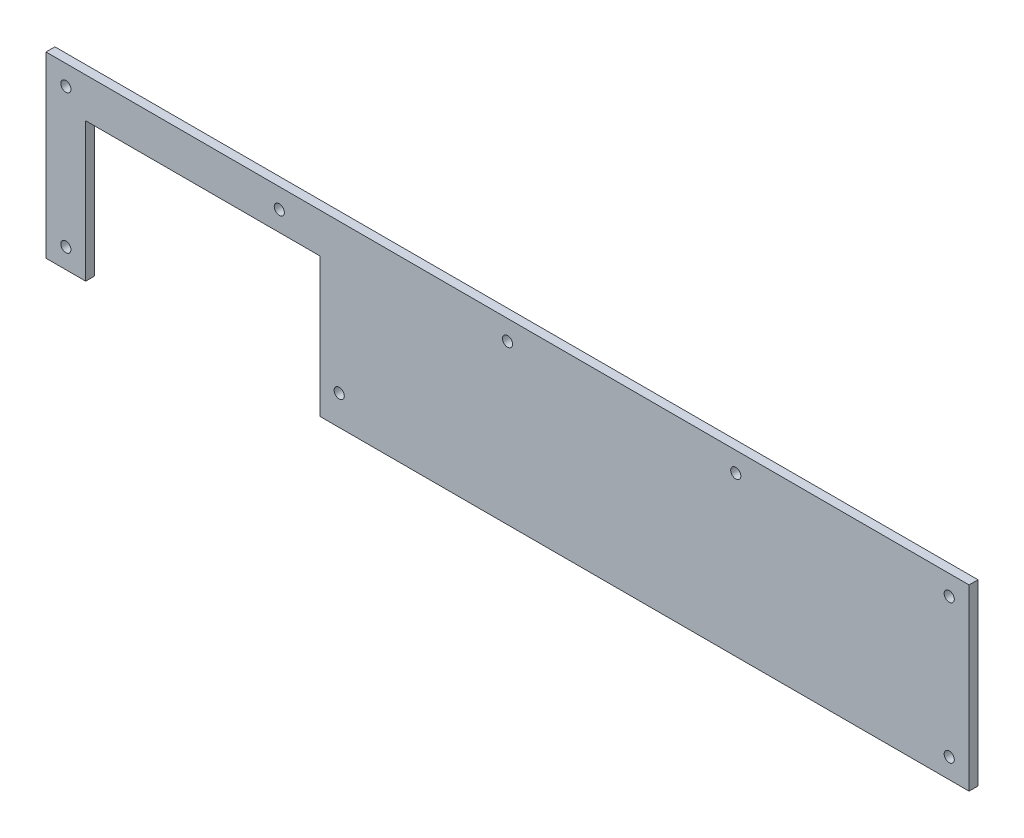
from build123d import *

# Parameters (mm, degrees)
SKETCH1_W           = 465
SKETCH1_H           = 90
SKETCH1_R           = 2.55
BOSS_EXTRUDE1_DEPTH = 2.2479
SKETCH5_W           = 118
SKETCH5_H           = 70
CUT_EXTRUDE2_DEPTH  = 237.85747237
SKETCH7_R           = 2.55
CUT_EXTRUDE3_DEPTH  = 4.4958


with BuildPart() as part:
    # Sketch1 → Boss-Extrude1 (new, symmetric)
    with BuildSketch(Plane.XY):
        Rectangle(SKETCH1_W, SKETCH1_H)
        with Locations((-222.5, 35)):
            Circle(SKETCH1_R, mode=Mode.SUBTRACT)
        with Locations((-222.5, -35)):
            Circle(SKETCH1_R, mode=Mode.SUBTRACT)
        with Locations((0, 35)):
            Circle(SKETCH1_R, mode=Mode.SUBTRACT)
        with Locations((-114.975, 35)):
            Circle(SKETCH1_R, mode=Mode.SUBTRACT)
        with Locations(Location((222.5, -35, 0), (0, 0, 180))):
            Circle(SKETCH1_R, mode=Mode.SUBTRACT)
        with Locations(Location((222.5, 35, 0), (0, 0, 180))):
            Circle(SKETCH1_R, mode=Mode.SUBTRACT)
        with Locations(Location((114.975, 35, 0), (0, 0, 180))):
            Circle(SKETCH1_R, mode=Mode.SUBTRACT)
    extrude(amount=BOSS_EXTRUDE1_DEPTH, both=True)

    # Sketch5 → Cut-Extrude2 (cut, through all)
    with BuildSketch(Plane(origin=(0, 0, -2.2479), x_dir=(-1, 0, 0), z_dir=(0, 0, -1))):
        with Locations((153.5, -10)):
            Rectangle(SKETCH5_W, SKETCH5_H)
    extrude(amount=-CUT_EXTRUDE2_DEPTH, mode=Mode.SUBTRACT)

    # Sketch7 → Cut-Extrude3 (cut)
    with BuildSketch(Plane(origin=(0, 0, -2.2479), x_dir=(-1, 0, 0), z_dir=(0, 0, -1))):
        with Locations((84.8, -30)):
            Circle(SKETCH7_R)
    extrude(amount=-CUT_EXTRUDE3_DEPTH, mode=Mode.SUBTRACT)


solid = part.part
